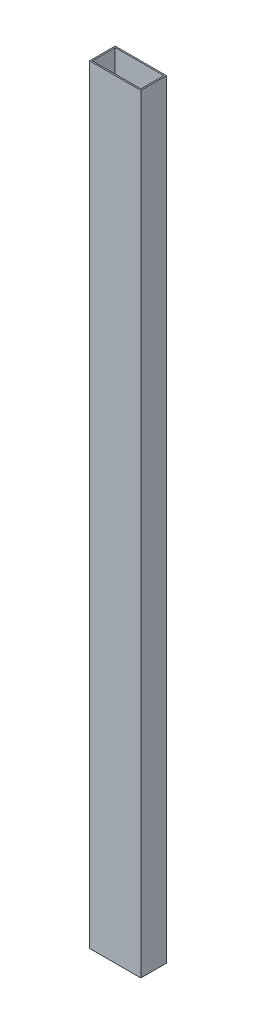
from build123d import *

# Parameters (mm, degrees)
ESQUISSE1_W        = 80
ESQUISSE1_H        = 40
ESQUISSE1_W_2      = 76
ESQUISSE1_H_2      = 36
BOSS_EXTRU_1_DEPTH = 1200


with BuildPart() as part:
    # Esquisse1 → Boss.-Extru.1 (new body)
    with BuildSketch(Plane(origin=(0, 0, 0), x_dir=(1, 0, 0), z_dir=(0, 1, 0))):
        Rectangle(ESQUISSE1_W, ESQUISSE1_H)
        Rectangle(ESQUISSE1_W_2, ESQUISSE1_H_2, mode=Mode.SUBTRACT)
    extrude(amount=BOSS_EXTRU_1_DEPTH)


solid = part.part
